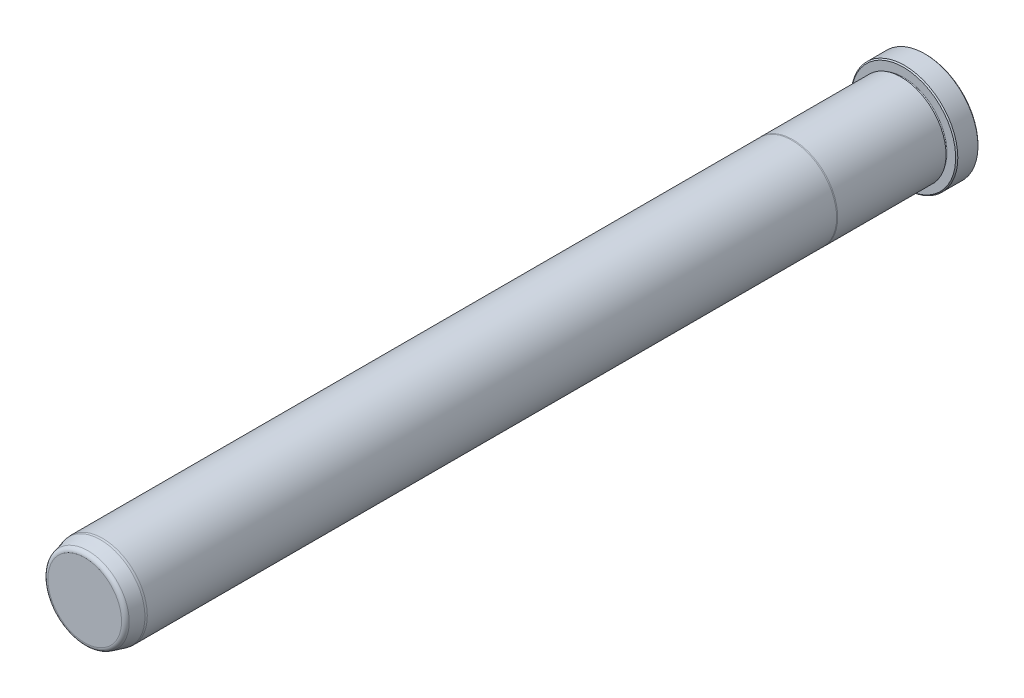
from build123d import *

# Parameters (mm, degrees)
FILLET6_R     = 1.5875
CHAMFER1_SIZE = 0.381


with BuildPart() as part:
    # Sketch1 → Revolve1 (revolve)
    with BuildSketch(Plane(origin=(0, 0, 0), x_dir=(0, 0, -1), z_dir=(1, 0, 0)), mode=Mode.PRIVATE) as revolve1_sk:
        with BuildLine():
            Line((0, 0), (0, 18.923))
            Line((0, 18.923), (-7.9248, 18.923))
            Line((-7.9248, 18.923), (-7.9248, 15.4813))
            ThreePointArc((-7.9248, 15.4813), (-8.3058, 15.1003), (-8.6868, 15.4813))
            Line((-8.6868, 15.4813), (-8.6868, 15.8877))
            Line((-8.6868, 15.8877), (-47.134763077, 15.8877))
            Line((-47.134763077, 15.8877), (-47.498, 15.8623))
            Line((-47.498, 15.8623), (-292.1, 15.8623))
            Line((-292.1, 15.8623), (-292.862, 15.795633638))
            Line((-292.862, 15.795633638), (-298.45, 14.298333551))
            Line((-298.45, 14.298333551), (-298.45, 0))
            Line((-298.45, 0), (0, 0))
        make_face()
    revolve(revolve1_sk.sketch.rotate(Axis((0, 0, 0), (0, 0, -1)), 90), axis=Axis((0, 0, 0), (0, 0, -1)))

    # Fillet6
    fillet6_edges = [part.edges().sort_by_distance(p)[0] for p in [
        (-14.298333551, 0, 298.45),
    ]]
    fillet(fillet6_edges, radius=FILLET6_R)

    # Chamfer1
    chamfer1_edges = [part.edges().sort_by_distance(p)[0] for p in [
        (-18.923, 0, 7.9248),
        (-18.923, 0, 0),
    ]]
    chamfer(chamfer1_edges, length=CHAMFER1_SIZE)


solid = part.part
